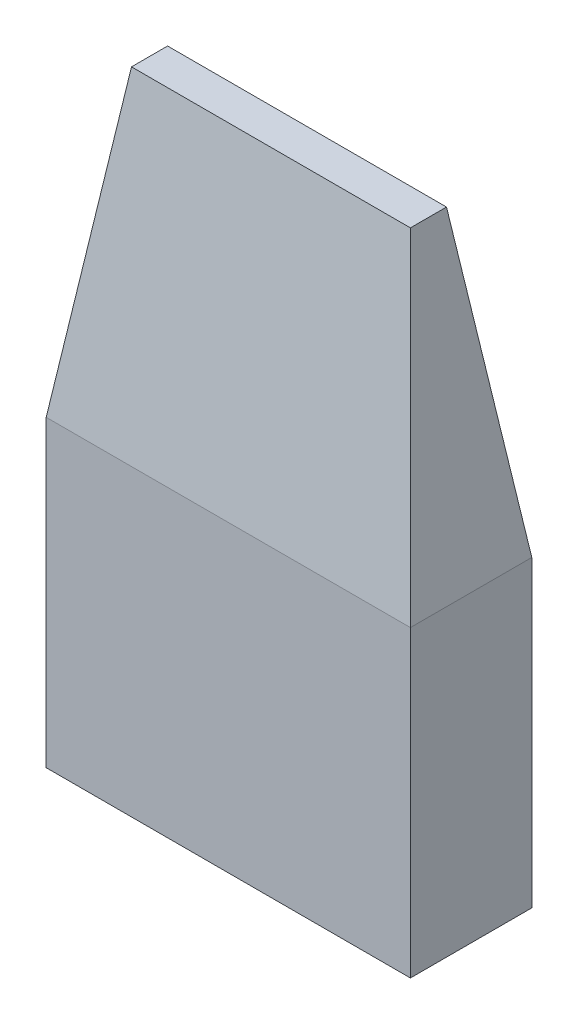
ISO-10303-21;
HEADER;
FILE_DESCRIPTION(('STEP AP214'),'2;1');
FILE_NAME('part.step','',(''),(''),'','','');
FILE_SCHEMA(('AUTOMOTIVE_DESIGN { 1 0 10303 214 1 1 1 1 }'));
ENDSEC;
DATA;
#1=APPLICATION_CONTEXT('core data for automotive mechanical design processes');
#2=APPLICATION_PROTOCOL_DEFINITION('international standard','automotive_design',2000,#1);
#3=PRODUCT_CONTEXT('',#1,'mechanical');
#4=PRODUCT('Part','Part','',(#3));
#5=PRODUCT_RELATED_PRODUCT_CATEGORY('part','',(#4));
#6=PRODUCT_DEFINITION_FORMATION('','',#4);
#7=PRODUCT_DEFINITION_CONTEXT('part definition',#1,'design');
#8=PRODUCT_DEFINITION('design','',#6,#7);
#9=PRODUCT_DEFINITION_SHAPE('','',#8);
#10=(LENGTH_UNIT() NAMED_UNIT(*) SI_UNIT(.MILLI.,.METRE.));
#11=(NAMED_UNIT(*) PLANE_ANGLE_UNIT() SI_UNIT($,.RADIAN.));
#12=(NAMED_UNIT(*) SI_UNIT($,.STERADIAN.) SOLID_ANGLE_UNIT());
#13=UNCERTAINTY_MEASURE_WITH_UNIT(LENGTH_MEASURE(1.E-05),#10,'distance_accuracy_value','');
#14=(GEOMETRIC_REPRESENTATION_CONTEXT(3) GLOBAL_UNCERTAINTY_ASSIGNED_CONTEXT((#13)) GLOBAL_UNIT_ASSIGNED_CONTEXT((#10,
#11,#12)) REPRESENTATION_CONTEXT('',''));
#15=CARTESIAN_POINT('',(0.,0.,0.));
#16=DIRECTION('',(0.,0.,1.));
#17=DIRECTION('',(1.,0.,0.));
#18=AXIS2_PLACEMENT_3D('',#15,#16,#17);
#19=CARTESIAN_POINT('',(-30.,-50.,10.));
#20=DIRECTION('',(0.,0.,1.));
#21=DIRECTION('',(1.,0.,0.));
#22=AXIS2_PLACEMENT_3D('',#19,#20,#21);
#23=PLANE('',#22);
#24=DIRECTION('',(0.,1.,0.));
#25=VECTOR('',#24,1.);
#26=CARTESIAN_POINT('',(30.,50.,10.));
#27=LINE('',#26,#25);
#28=CARTESIAN_POINT('',(30.,-50.,10.));
#29=VERTEX_POINT('',#28);
#30=CARTESIAN_POINT('',(30.,0.,10.));
#31=VERTEX_POINT('',#30);
#32=EDGE_CURVE('E96',#29,#31,#27,.T.);
#33=ORIENTED_EDGE('',*,*,#32,.T.);
#34=DIRECTION('',(-1.,0.,0.));
#35=VECTOR('',#34,1.);
#36=CARTESIAN_POINT('',(-30.,0.,10.));
#37=LINE('',#36,#35);
#38=CARTESIAN_POINT('',(-30.,0.,10.));
#39=VERTEX_POINT('',#38);
#40=EDGE_CURVE('E12',#31,#39,#37,.T.);
#41=ORIENTED_EDGE('',*,*,#40,.T.);
#42=DIRECTION('',(0.,-1.,0.));
#43=VECTOR('',#42,1.);
#44=CARTESIAN_POINT('',(-30.,50.,10.));
#45=LINE('',#44,#43);
#46=CARTESIAN_POINT('',(-30.,-50.,10.));
#47=VERTEX_POINT('',#46);
#48=EDGE_CURVE('E93',#39,#47,#45,.T.);
#49=ORIENTED_EDGE('',*,*,#48,.T.);
#50=DIRECTION('',(1.,0.,0.));
#51=VECTOR('',#50,1.);
#52=CARTESIAN_POINT('',(-30.,-50.,10.));
#53=LINE('',#52,#51);
#54=EDGE_CURVE('E118',#47,#29,#53,.T.);
#55=ORIENTED_EDGE('',*,*,#54,.T.);
#56=EDGE_LOOP('',(#33,#41,#49,#55));
#57=FACE_BOUND('',#56,.T.);
#58=ADVANCED_FACE('F33',(#57),#23,.T.);
#59=CARTESIAN_POINT('',(30.,0.,10.));
#60=DIRECTION('',(0.99026806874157,0.139173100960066,0.));
#61=DIRECTION('',(-0.139173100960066,0.99026806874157,0.));
#62=AXIS2_PLACEMENT_3D('',#59,#60,#61);
#63=PLANE('',#62);
#64=DIRECTION('',(0.137844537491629,-0.980814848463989,0.137844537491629));
#65=VECTOR('',#64,1.);
#66=CARTESIAN_POINT('',(30.,0.,10.));
#67=LINE('',#66,#65);
#68=CARTESIAN_POINT('',(22.9729582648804,50.,2.97295826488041));
#69=VERTEX_POINT('',#68);
#70=EDGE_CURVE('E120',#31,#69,#67,.F.);
#71=ORIENTED_EDGE('',*,*,#70,.F.);
#72=DIRECTION('',(0.,0.,-1.));
#73=VECTOR('',#72,1.);
#74=CARTESIAN_POINT('',(30.,0.,10.));
#75=LINE('',#74,#73);
#76=CARTESIAN_POINT('',(30.,0.,-10.));
#77=VERTEX_POINT('',#76);
#78=EDGE_CURVE('E43',#31,#77,#75,.T.);
#79=ORIENTED_EDGE('',*,*,#78,.T.);
#80=DIRECTION('',(-0.137844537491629,0.980814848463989,0.137844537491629));
#81=VECTOR('',#80,1.);
#82=CARTESIAN_POINT('',(29.6199776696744,2.70399938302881,-9.61997766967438));
#83=LINE('',#82,#81);
#84=CARTESIAN_POINT('',(22.9729582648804,50.,-2.97295826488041));
#85=VERTEX_POINT('',#84);
#86=EDGE_CURVE('E69',#77,#85,#83,.T.);
#87=ORIENTED_EDGE('',*,*,#86,.T.);
#88=DIRECTION('',(0.,0.,1.));
#89=VECTOR('',#88,1.);
#90=CARTESIAN_POINT('',(22.9729582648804,50.,10.));
#91=LINE('',#90,#89);
#92=EDGE_CURVE('E129',#69,#85,#91,.F.);
#93=ORIENTED_EDGE('',*,*,#92,.F.);
#94=EDGE_LOOP('',(#71,#79,#87,#93));
#95=FACE_BOUND('',#94,.T.);
#96=ADVANCED_FACE('F144',(#95),#63,.T.);
#97=CARTESIAN_POINT('',(-30.,0.,-10.));
#98=DIRECTION('',(0.,0.139173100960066,-0.99026806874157));
#99=DIRECTION('',(0.,0.99026806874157,0.139173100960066));
#100=AXIS2_PLACEMENT_3D('',#97,#98,#99);
#101=PLANE('',#100);
#102=ORIENTED_EDGE('',*,*,#86,.F.);
#103=DIRECTION('',(-1.,0.,0.));
#104=VECTOR('',#103,1.);
#105=CARTESIAN_POINT('',(-30.,0.,-10.));
#106=LINE('',#105,#104);
#107=CARTESIAN_POINT('',(-30.,0.,-10.));
#108=VERTEX_POINT('',#107);
#109=EDGE_CURVE('E109',#77,#108,#106,.T.);
#110=ORIENTED_EDGE('',*,*,#109,.T.);
#111=DIRECTION('',(-0.137844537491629,-0.980814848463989,-0.137844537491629));
#112=VECTOR('',#111,1.);
#113=CARTESIAN_POINT('',(-29.6199776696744,2.70399938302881,-9.61997766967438));
#114=LINE('',#113,#112);
#115=CARTESIAN_POINT('',(-22.9729582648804,50.,-2.97295826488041));
#116=VERTEX_POINT('',#115);
#117=EDGE_CURVE('E106',#116,#108,#114,.T.);
#118=ORIENTED_EDGE('',*,*,#117,.F.);
#119=DIRECTION('',(1.,0.,0.));
#120=VECTOR('',#119,1.);
#121=CARTESIAN_POINT('',(-30.,50.,-2.97295826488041));
#122=LINE('',#121,#120);
#123=EDGE_CURVE('E37',#85,#116,#122,.F.);
#124=ORIENTED_EDGE('',*,*,#123,.F.);
#125=EDGE_LOOP('',(#102,#110,#118,#124));
#126=FACE_BOUND('',#125,.T.);
#127=ADVANCED_FACE('F149',(#126),#101,.T.);
#128=CARTESIAN_POINT('',(-30.,0.,10.));
#129=DIRECTION('',(-0.99026806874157,0.139173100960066,0.));
#130=DIRECTION('',(-0.139173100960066,-0.99026806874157,0.));
#131=AXIS2_PLACEMENT_3D('',#128,#129,#130);
#132=PLANE('',#131);
#133=ORIENTED_EDGE('',*,*,#117,.T.);
#134=DIRECTION('',(0.,0.,1.));
#135=VECTOR('',#134,1.);
#136=CARTESIAN_POINT('',(-30.,0.,10.));
#137=LINE('',#136,#135);
#138=EDGE_CURVE('E101',#108,#39,#137,.T.);
#139=ORIENTED_EDGE('',*,*,#138,.T.);
#140=DIRECTION('',(0.137844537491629,0.980814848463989,-0.137844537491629));
#141=VECTOR('',#140,1.);
#142=CARTESIAN_POINT('',(-30.,0.,10.));
#143=LINE('',#142,#141);
#144=CARTESIAN_POINT('',(-22.9729582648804,50.,2.97295826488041));
#145=VERTEX_POINT('',#144);
#146=EDGE_CURVE('E104',#145,#39,#143,.F.);
#147=ORIENTED_EDGE('',*,*,#146,.F.);
#148=DIRECTION('',(0.,0.,1.));
#149=VECTOR('',#148,1.);
#150=CARTESIAN_POINT('',(-22.9729582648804,50.,10.));
#151=LINE('',#150,#149);
#152=EDGE_CURVE('E127',#145,#116,#151,.F.);
#153=ORIENTED_EDGE('',*,*,#152,.T.);
#154=EDGE_LOOP('',(#133,#139,#147,#153));
#155=FACE_BOUND('',#154,.T.);
#156=ADVANCED_FACE('F102',(#155),#132,.T.);
#157=CARTESIAN_POINT('',(-30.,50.,10.));
#158=DIRECTION('',(1.,0.,0.));
#159=DIRECTION('',(0.,1.,0.));
#160=AXIS2_PLACEMENT_3D('',#157,#158,#159);
#161=PLANE('',#160);
#162=ORIENTED_EDGE('',*,*,#138,.F.);
#163=DIRECTION('',(0.,-1.,0.));
#164=VECTOR('',#163,1.);
#165=CARTESIAN_POINT('',(-30.,50.,-10.));
#166=LINE('',#165,#164);
#167=CARTESIAN_POINT('',(-30.,-50.,-10.));
#168=VERTEX_POINT('',#167);
#169=EDGE_CURVE('E147',#108,#168,#166,.T.);
#170=ORIENTED_EDGE('',*,*,#169,.T.);
#171=DIRECTION('',(0.,0.,-1.));
#172=VECTOR('',#171,1.);
#173=CARTESIAN_POINT('',(-30.,-50.,10.));
#174=LINE('',#173,#172);
#175=EDGE_CURVE('E110',#47,#168,#174,.T.);
#176=ORIENTED_EDGE('',*,*,#175,.F.);
#177=ORIENTED_EDGE('',*,*,#48,.F.);
#178=EDGE_LOOP('',(#162,#170,#176,#177));
#179=FACE_BOUND('',#178,.T.);
#180=ADVANCED_FACE('F113',(#179),#161,.F.);
#181=CARTESIAN_POINT('',(-30.,-50.,10.));
#182=DIRECTION('',(0.,1.,0.));
#183=DIRECTION('',(0.,0.,1.));
#184=AXIS2_PLACEMENT_3D('',#181,#182,#183);
#185=PLANE('',#184);
#186=DIRECTION('',(1.,0.,0.));
#187=VECTOR('',#186,1.);
#188=CARTESIAN_POINT('',(-30.,-50.,-10.));
#189=LINE('',#188,#187);
#190=CARTESIAN_POINT('',(30.,-50.,-10.));
#191=VERTEX_POINT('',#190);
#192=EDGE_CURVE('E80',#168,#191,#189,.T.);
#193=ORIENTED_EDGE('',*,*,#192,.T.);
#194=DIRECTION('',(0.,0.,-1.));
#195=VECTOR('',#194,1.);
#196=CARTESIAN_POINT('',(30.,-50.,10.));
#197=LINE('',#196,#195);
#198=EDGE_CURVE('E130',#29,#191,#197,.T.);
#199=ORIENTED_EDGE('',*,*,#198,.F.);
#200=ORIENTED_EDGE('',*,*,#54,.F.);
#201=ORIENTED_EDGE('',*,*,#175,.T.);
#202=EDGE_LOOP('',(#193,#199,#200,#201));
#203=FACE_BOUND('',#202,.T.);
#204=ADVANCED_FACE('F154',(#203),#185,.F.);
#205=CARTESIAN_POINT('',(30.,50.,10.));
#206=DIRECTION('',(-1.,0.,0.));
#207=DIRECTION('',(0.,-1.,0.));
#208=AXIS2_PLACEMENT_3D('',#205,#206,#207);
#209=PLANE('',#208);
#210=ORIENTED_EDGE('',*,*,#78,.F.);
#211=ORIENTED_EDGE('',*,*,#32,.F.);
#212=ORIENTED_EDGE('',*,*,#198,.T.);
#213=DIRECTION('',(0.,1.,0.));
#214=VECTOR('',#213,1.);
#215=CARTESIAN_POINT('',(30.,50.,-10.));
#216=LINE('',#215,#214);
#217=EDGE_CURVE('E125',#191,#77,#216,.T.);
#218=ORIENTED_EDGE('',*,*,#217,.T.);
#219=EDGE_LOOP('',(#210,#211,#212,#218));
#220=FACE_BOUND('',#219,.T.);
#221=ADVANCED_FACE('F150',(#220),#209,.F.);
#222=CARTESIAN_POINT('',(-30.,50.,10.));
#223=DIRECTION('',(0.,-1.,0.));
#224=DIRECTION('',(1.,0.,0.));
#225=AXIS2_PLACEMENT_3D('',#222,#223,#224);
#226=PLANE('',#225);
#227=ORIENTED_EDGE('',*,*,#123,.T.);
#228=ORIENTED_EDGE('',*,*,#152,.F.);
#229=DIRECTION('',(-1.,0.,0.));
#230=VECTOR('',#229,1.);
#231=CARTESIAN_POINT('',(-30.,50.,2.97295826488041));
#232=LINE('',#231,#230);
#233=EDGE_CURVE('E116',#69,#145,#232,.T.);
#234=ORIENTED_EDGE('',*,*,#233,.F.);
#235=ORIENTED_EDGE('',*,*,#92,.T.);
#236=EDGE_LOOP('',(#227,#228,#234,#235));
#237=FACE_BOUND('',#236,.T.);
#238=ADVANCED_FACE('F151',(#237),#226,.F.);
#239=CARTESIAN_POINT('',(-30.,0.,10.));
#240=DIRECTION('',(0.,0.139173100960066,0.99026806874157));
#241=DIRECTION('',(0.,-0.99026806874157,0.139173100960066));
#242=AXIS2_PLACEMENT_3D('',#239,#240,#241);
#243=PLANE('',#242);
#244=ORIENTED_EDGE('',*,*,#40,.F.);
#245=ORIENTED_EDGE('',*,*,#70,.T.);
#246=ORIENTED_EDGE('',*,*,#233,.T.);
#247=ORIENTED_EDGE('',*,*,#146,.T.);
#248=EDGE_LOOP('',(#244,#245,#246,#247));
#249=FACE_BOUND('',#248,.T.);
#250=ADVANCED_FACE('F35',(#249),#243,.T.);
#251=CARTESIAN_POINT('',(-30.,-50.,-10.));
#252=DIRECTION('',(0.,0.,1.));
#253=DIRECTION('',(1.,0.,0.));
#254=AXIS2_PLACEMENT_3D('',#251,#252,#253);
#255=PLANE('',#254);
#256=ORIENTED_EDGE('',*,*,#109,.F.);
#257=ORIENTED_EDGE('',*,*,#217,.F.);
#258=ORIENTED_EDGE('',*,*,#192,.F.);
#259=ORIENTED_EDGE('',*,*,#169,.F.);
#260=EDGE_LOOP('',(#256,#257,#258,#259));
#261=FACE_BOUND('',#260,.T.);
#262=ADVANCED_FACE('F146',(#261),#255,.F.);
#263=CLOSED_SHELL('',(#58,#96,#127,#156,#180,#204,#221,#238,#250,#262));
#264=MANIFOLD_SOLID_BREP('B2',#263);
#265=ADVANCED_BREP_SHAPE_REPRESENTATION('',(#18,#264),#14);
#266=SHAPE_DEFINITION_REPRESENTATION(#9,#265);
ENDSEC;
END-ISO-10303-21;
